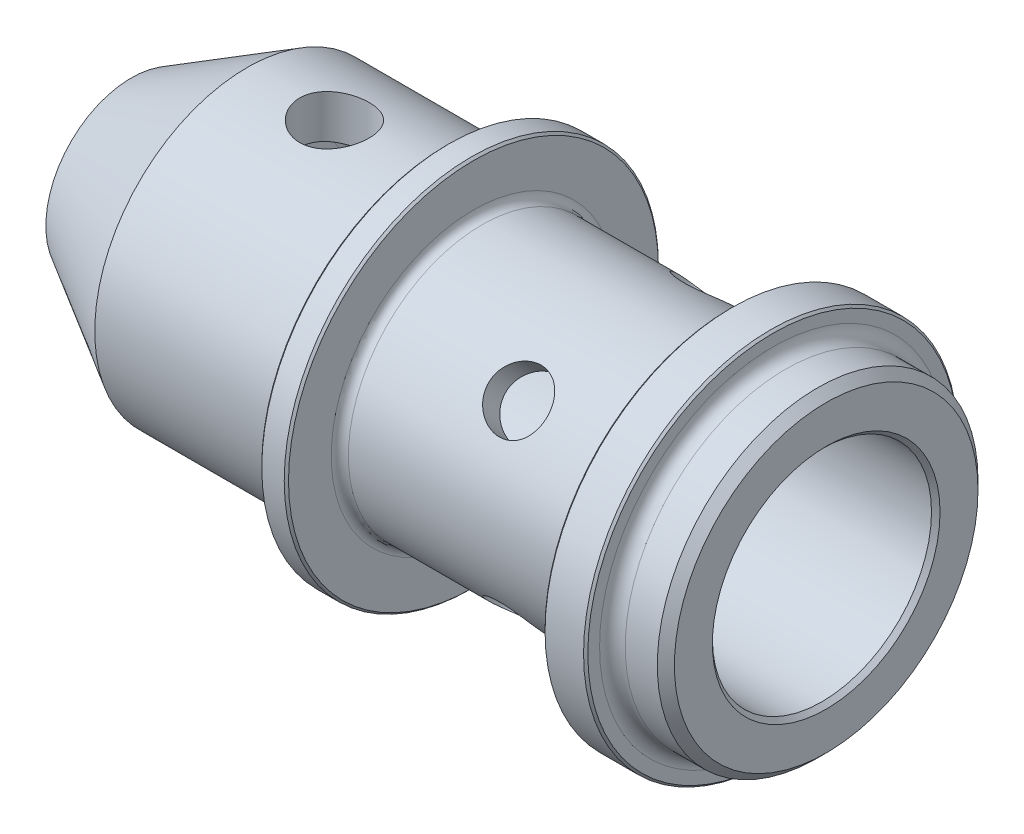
from build123d import *

# Parameters (mm, degrees)
SKETCH2_R               = 10.25
CUT_EXTRUDE1_DEPTH      = 53
CUT_EXTRUDE2_REACH      = 71.552
SKETCH3_R               = 3.6
FILLET1_R               = 1.5
SKETCH4_R               = 2.75
CUT_EXTRUDE3_DEPTH      = 70.552138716
CUT_EXTRUDE4_DEPTH      = 70.55213881
CUT_EXTRUDE4_DEPTH_BACK = 70.55213881
SKETCH5_R               = 3.25
FILLET2_R               = 1.2
FILLET3_R               = 0.8
CHAMFER1_SIZE           = 0.8
CIRPATTERN1_COUNT       = 4
CHAMFER2_SIZE           = 0.2
CHAMFER4_SIZE           = 0.4


with BuildPart() as part:
    # Sketch1 → Revolve1 (revolve)
    with BuildSketch(Plane.XY, mode=Mode.PRIVATE) as revolve1_sk:
        Polygon((0, 0), (65, 0), (65, 15), (60, 15), (60, 17.5), (56, 17.5), (56, 12.5), (32, 12.5), (32, 17.5), (29.5, 17.5), (29.5, 14.25), (10.825317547, 14.25), (0, 8), align=None)
    revolve(revolve1_sk.sketch.rotate(Axis((0, 0, 0), (-1, 0, 0)), 90), axis=Axis((0, 0, 0), (-1, 0, 0)))

    # Sketch2 → Cut-Extrude1 (cut)
    with BuildSketch(Plane(origin=(65, 0, 0), x_dir=(0, 0, -1), z_dir=(1, 0, 0))):
        Circle(SKETCH2_R)
    extrude(amount=-CUT_EXTRUDE1_DEPTH, mode=Mode.SUBTRACT)

    # Sketch3 → Cut-Extrude2 (cut, up to next)
    with BuildSketch(Plane.ZY, mode=Mode.PRIVATE) as cut_extrude2_sk1:
        Circle(SKETCH3_R)
    cut_extrude2_tool1 = extrude(cut_extrude2_sk1.sketch, amount=-CUT_EXTRUDE2_REACH, mode=Mode.PRIVATE) & part.part
    add(cut_extrude2_tool1.solids().sort_by_distance((0, 0, 0))[0], mode=Mode.SUBTRACT)

    # Fillet1
    fillet1_edges = [part.edges().sort_by_distance(p)[0] for p in [
        (12, 0, 10.25),
    ]]
    fillet(fillet1_edges, radius=FILLET1_R)

    # Sketch4 → Cut-Extrude3 (cut, through all)
    with BuildSketch(Plane(origin=(0, 0, 0), x_dir=(1, 0, 0), z_dir=(0, -0.7071067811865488, 0.7071067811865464))):
        with Locations(Location((45, 0, 0), (0, 0, 270))):
            Circle(SKETCH4_R)
    cut_extrude3 = extrude(amount=-CUT_EXTRUDE3_DEPTH, mode=Mode.SUBTRACT)

    # Sketch5 → Cut-Extrude4 (cut, two sides: drawn at the far end of the back side and taken through both)
    with BuildSketch(Plane(origin=(0, 0, 0), x_dir=(1, 0, 0), z_dir=(0, 1, 0)).offset(-CUT_EXTRUDE4_DEPTH_BACK)):
        with Locations(Location((19, 0, 0), (0, 0, 270))):
            Circle(SKETCH5_R)
    extrude(amount=CUT_EXTRUDE4_DEPTH + CUT_EXTRUDE4_DEPTH_BACK, mode=Mode.SUBTRACT)

    # Fillet2
    fillet2_edges = [part.edges().sort_by_distance(p)[0] for p in [
        (56, 0, 12.5),
        (60, 0, 15),
    ]]
    fillet(fillet2_edges, radius=FILLET2_R)

    # Fillet3
    fillet3_edges = [part.edges().sort_by_distance(p)[0] for p in [
        (32, 0, 12.5),
        (29.5, 0, 14.25),
    ]]
    fillet(fillet3_edges, radius=FILLET3_R)

    # Chamfer1
    chamfer1_edges = [part.edges().sort_by_distance(p)[0] for p in [
        (65, 0, 15),
    ]]
    chamfer(chamfer1_edges, length=CHAMFER1_SIZE)

    # CirPattern1: Cut-Extrude3 ×4 about axis
    cirpattern1_axis = Axis((0, 0, 0), (1, 0, 0))
    for i in range(1, CIRPATTERN1_COUNT):
        add(cut_extrude3.rotate(cirpattern1_axis, i * 360 / CIRPATTERN1_COUNT), mode=Mode.SUBTRACT)

    # Chamfer2
    chamfer2_edges = [part.edges().sort_by_distance(p)[0] for p in [
        (29.5, 0, 17.5),
        (32, 0, 17.5),
        (56, 0, 17.5),
        (60, 0, 17.5),
    ]]
    chamfer(chamfer2_edges, length=CHAMFER2_SIZE)

    # Chamfer4
    chamfer4_edges = [part.edges().sort_by_distance(p)[0] for p in [
        (65, 0, 10.25),
    ]]
    chamfer(chamfer4_edges, length=CHAMFER4_SIZE)


solid = part.part
